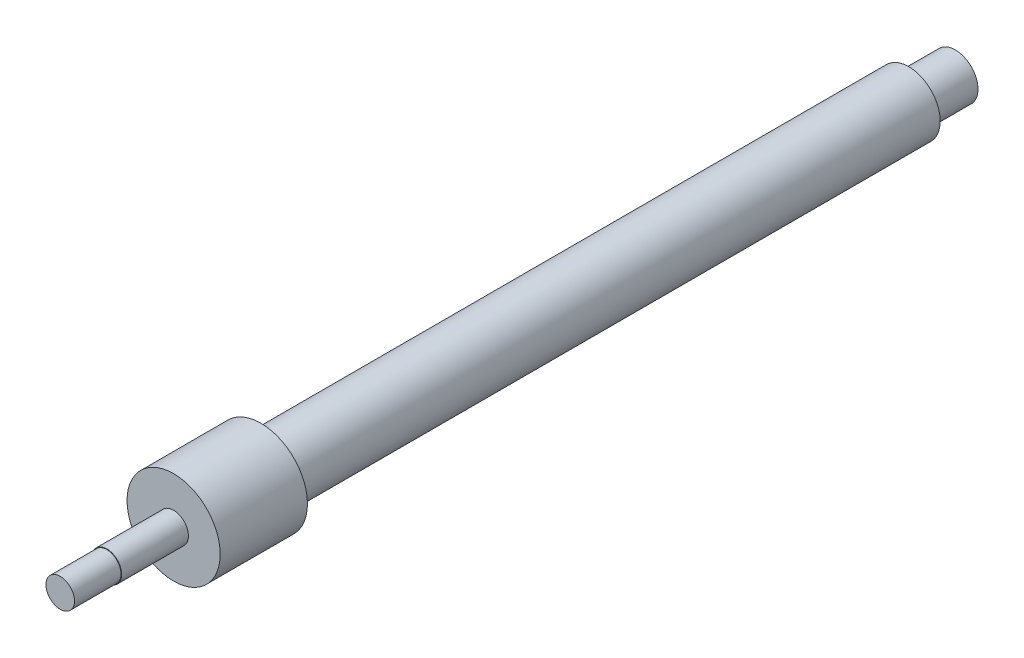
ISO-10303-21;
HEADER;
FILE_DESCRIPTION(('STEP AP214'),'2;1');
FILE_NAME('part.step','',(''),(''),'','','');
FILE_SCHEMA(('AUTOMOTIVE_DESIGN { 1 0 10303 214 1 1 1 1 }'));
ENDSEC;
DATA;
#1=APPLICATION_CONTEXT('core data for automotive mechanical design processes');
#2=APPLICATION_PROTOCOL_DEFINITION('international standard','automotive_design',2000,#1);
#3=PRODUCT_CONTEXT('',#1,'mechanical');
#4=PRODUCT('Part','Part','',(#3));
#5=PRODUCT_RELATED_PRODUCT_CATEGORY('part','',(#4));
#6=PRODUCT_DEFINITION_FORMATION('','',#4);
#7=PRODUCT_DEFINITION_CONTEXT('part definition',#1,'design');
#8=PRODUCT_DEFINITION('design','',#6,#7);
#9=PRODUCT_DEFINITION_SHAPE('','',#8);
#10=(LENGTH_UNIT() NAMED_UNIT(*) SI_UNIT(.MILLI.,.METRE.));
#11=(NAMED_UNIT(*) PLANE_ANGLE_UNIT() SI_UNIT($,.RADIAN.));
#12=(NAMED_UNIT(*) SI_UNIT($,.STERADIAN.) SOLID_ANGLE_UNIT());
#13=UNCERTAINTY_MEASURE_WITH_UNIT(LENGTH_MEASURE(1.E-05),#10,'distance_accuracy_value','');
#14=(GEOMETRIC_REPRESENTATION_CONTEXT(3) GLOBAL_UNCERTAINTY_ASSIGNED_CONTEXT((#13)) GLOBAL_UNIT_ASSIGNED_CONTEXT((#10,
#11,#12)) REPRESENTATION_CONTEXT('',''));
#15=CARTESIAN_POINT('',(0.,0.,0.));
#16=DIRECTION('',(0.,0.,1.));
#17=DIRECTION('',(1.,0.,0.));
#18=AXIS2_PLACEMENT_3D('',#15,#16,#17);
#19=CARTESIAN_POINT('',(0.,0.,0.));
#20=DIRECTION('',(0.,0.,1.));
#21=DIRECTION('',(1.,0.,0.));
#22=AXIS2_PLACEMENT_3D('',#19,#20,#21);
#23=PLANE('',#22);
#24=CARTESIAN_POINT('',(0.,0.,0.));
#25=DIRECTION('',(0.,0.,1.));
#26=DIRECTION('',(1.,0.,0.));
#27=AXIS2_PLACEMENT_3D('',#24,#25,#26);
#28=CIRCLE('',#27,2.7);
#29=CARTESIAN_POINT('',(2.7,0.,0.));
#30=VERTEX_POINT('',#29);
#31=EDGE_CURVE('E47',#30,#30,#28,.T.);
#32=ORIENTED_EDGE('',*,*,#31,.F.);
#33=EDGE_LOOP('',(#32));
#34=FACE_BOUND('',#33,.T.);
#35=CARTESIAN_POINT('',(0.,0.,0.));
#36=DIRECTION('',(0.,0.,1.));
#37=DIRECTION('',(1.,0.,0.));
#38=AXIS2_PLACEMENT_3D('',#35,#36,#37);
#39=CIRCLE('',#38,1.95);
#40=CARTESIAN_POINT('',(1.95,0.,0.));
#41=VERTEX_POINT('',#40);
#42=EDGE_CURVE('E10',#41,#41,#39,.F.);
#43=ORIENTED_EDGE('',*,*,#42,.F.);
#44=EDGE_LOOP('',(#43));
#45=FACE_BOUND('',#44,.T.);
#46=ADVANCED_FACE('F34',(#34,#45),#23,.F.);
#47=CARTESIAN_POINT('',(0.,0.,55.66));
#48=DIRECTION('',(0.,0.,-1.));
#49=DIRECTION('',(-1.,0.,0.));
#50=AXIS2_PLACEMENT_3D('',#47,#48,#49);
#51=CYLINDRICAL_SURFACE('',#50,2.7);
#52=CARTESIAN_POINT('',(0.,0.,55.66));
#53=DIRECTION('',(0.,0.,1.));
#54=DIRECTION('',(1.,0.,0.));
#55=AXIS2_PLACEMENT_3D('',#52,#53,#54);
#56=CIRCLE('',#55,2.7);
#57=CARTESIAN_POINT('',(2.7,0.,55.66));
#58=VERTEX_POINT('',#57);
#59=EDGE_CURVE('E42',#58,#58,#56,.T.);
#60=ORIENTED_EDGE('',*,*,#59,.F.);
#61=EDGE_LOOP('',(#60));
#62=FACE_BOUND('',#61,.T.);
#63=ORIENTED_EDGE('',*,*,#31,.T.);
#64=EDGE_LOOP('',(#63));
#65=FACE_BOUND('',#64,.T.);
#66=ADVANCED_FACE('F36',(#62,#65),#51,.T.);
#67=CARTESIAN_POINT('',(0.,0.,-4.));
#68=DIRECTION('',(0.,0.,1.));
#69=DIRECTION('',(1.,0.,0.));
#70=AXIS2_PLACEMENT_3D('',#67,#68,#69);
#71=CYLINDRICAL_SURFACE('',#70,1.95);
#72=CARTESIAN_POINT('',(0.,0.,-4.));
#73=DIRECTION('',(0.,0.,-1.));
#74=DIRECTION('',(-1.,0.,0.));
#75=AXIS2_PLACEMENT_3D('',#72,#73,#74);
#76=CIRCLE('',#75,1.95);
#77=CARTESIAN_POINT('',(-1.95,0.,-4.));
#78=VERTEX_POINT('',#77);
#79=EDGE_CURVE('E52',#78,#78,#76,.T.);
#80=ORIENTED_EDGE('',*,*,#79,.F.);
#81=EDGE_LOOP('',(#80));
#82=FACE_BOUND('',#81,.T.);
#83=ORIENTED_EDGE('',*,*,#42,.T.);
#84=EDGE_LOOP('',(#83));
#85=FACE_BOUND('',#84,.T.);
#86=ADVANCED_FACE('F80',(#82,#85),#71,.T.);
#87=CARTESIAN_POINT('',(0.,0.,-4.));
#88=DIRECTION('',(0.,0.,-1.));
#89=DIRECTION('',(-1.,0.,0.));
#90=AXIS2_PLACEMENT_3D('',#87,#88,#89);
#91=PLANE('',#90);
#92=ORIENTED_EDGE('',*,*,#79,.T.);
#93=EDGE_LOOP('',(#92));
#94=FACE_BOUND('',#93,.T.);
#95=ADVANCED_FACE('F93',(#94),#91,.T.);
#96=CARTESIAN_POINT('',(0.,0.,44.3462915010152));
#97=DIRECTION('',(0.,0.,1.));
#98=DIRECTION('',(1.,0.,0.));
#99=AXIS2_PLACEMENT_3D('',#96,#97,#98);
#100=CYLINDRICAL_SURFACE('',#99,4.);
#101=CARTESIAN_POINT('',(0.,0.,55.66));
#102=DIRECTION('',(0.,0.,1.));
#103=DIRECTION('',(1.,0.,0.));
#104=AXIS2_PLACEMENT_3D('',#101,#102,#103);
#105=CIRCLE('',#104,4.);
#106=CARTESIAN_POINT('',(4.,0.,55.66));
#107=VERTEX_POINT('',#106);
#108=EDGE_CURVE('E64',#107,#107,#105,.T.);
#109=ORIENTED_EDGE('',*,*,#108,.T.);
#110=EDGE_LOOP('',(#109));
#111=FACE_BOUND('',#110,.T.);
#112=CARTESIAN_POINT('',(0.,0.,63.16));
#113=DIRECTION('',(0.,0.,-1.));
#114=DIRECTION('',(-1.,0.,0.));
#115=AXIS2_PLACEMENT_3D('',#112,#113,#114);
#116=CIRCLE('',#115,4.);
#117=CARTESIAN_POINT('',(-4.,0.,63.16));
#118=VERTEX_POINT('',#117);
#119=EDGE_CURVE('E121',#118,#118,#116,.T.);
#120=ORIENTED_EDGE('',*,*,#119,.T.);
#121=EDGE_LOOP('',(#120));
#122=FACE_BOUND('',#121,.T.);
#123=ADVANCED_FACE('F97',(#111,#122),#100,.T.);
#124=CARTESIAN_POINT('',(0.,0.,55.66));
#125=DIRECTION('',(0.,0.,1.));
#126=DIRECTION('',(1.,0.,0.));
#127=AXIS2_PLACEMENT_3D('',#124,#125,#126);
#128=PLANE('',#127);
#129=ORIENTED_EDGE('',*,*,#59,.T.);
#130=EDGE_LOOP('',(#129));
#131=FACE_BOUND('',#130,.T.);
#132=ORIENTED_EDGE('',*,*,#108,.F.);
#133=EDGE_LOOP('',(#132));
#134=FACE_BOUND('',#133,.T.);
#135=ADVANCED_FACE('F108',(#131,#134),#128,.F.);
#136=CARTESIAN_POINT('',(0.,0.,63.16));
#137=DIRECTION('',(0.,0.,-1.));
#138=DIRECTION('',(-1.,0.,0.));
#139=AXIS2_PLACEMENT_3D('',#136,#137,#138);
#140=PLANE('',#139);
#141=CARTESIAN_POINT('',(0.,0.,63.16));
#142=DIRECTION('',(0.,0.,-1.));
#143=DIRECTION('',(-1.,0.,0.));
#144=AXIS2_PLACEMENT_3D('',#141,#142,#143);
#145=CIRCLE('',#144,1.275);
#146=CARTESIAN_POINT('',(-1.275,0.,63.16));
#147=VERTEX_POINT('',#146);
#148=EDGE_CURVE('E38',#147,#147,#145,.F.);
#149=ORIENTED_EDGE('',*,*,#148,.F.);
#150=EDGE_LOOP('',(#149));
#151=FACE_BOUND('',#150,.T.);
#152=ORIENTED_EDGE('',*,*,#119,.F.);
#153=EDGE_LOOP('',(#152));
#154=FACE_BOUND('',#153,.T.);
#155=ADVANCED_FACE('F90',(#151,#154),#140,.F.);
#156=CARTESIAN_POINT('',(0.,0.,72.9));
#157=DIRECTION('',(0.,0.,1.));
#158=DIRECTION('',(1.,0.,0.));
#159=AXIS2_PLACEMENT_3D('',#156,#157,#158);
#160=PLANE('',#159);
#161=CARTESIAN_POINT('',(0.,0.,72.9));
#162=DIRECTION('',(0.,0.,1.));
#163=DIRECTION('',(1.,0.,0.));
#164=AXIS2_PLACEMENT_3D('',#161,#162,#163);
#165=CIRCLE('',#164,1.225);
#166=CARTESIAN_POINT('',(1.225,0.,72.9));
#167=VERTEX_POINT('',#166);
#168=EDGE_CURVE('E57',#167,#167,#165,.T.);
#169=ORIENTED_EDGE('',*,*,#168,.T.);
#170=EDGE_LOOP('',(#169));
#171=FACE_BOUND('',#170,.T.);
#172=ADVANCED_FACE('F87',(#171),#160,.T.);
#173=CARTESIAN_POINT('',(0.,0.,72.9));
#174=DIRECTION('',(0.,0.,-1.));
#175=DIRECTION('',(-1.,0.,0.));
#176=AXIS2_PLACEMENT_3D('',#173,#174,#175);
#177=CYLINDRICAL_SURFACE('',#176,1.225);
#178=CARTESIAN_POINT('',(0.,0.,68.9));
#179=DIRECTION('',(0.,0.,1.));
#180=DIRECTION('',(1.,0.,0.));
#181=AXIS2_PLACEMENT_3D('',#178,#179,#180);
#182=CIRCLE('',#181,1.225);
#183=CARTESIAN_POINT('',(1.225,0.,68.9));
#184=VERTEX_POINT('',#183);
#185=EDGE_CURVE('E50',#184,#184,#182,.T.);
#186=ORIENTED_EDGE('',*,*,#185,.T.);
#187=EDGE_LOOP('',(#186));
#188=FACE_BOUND('',#187,.T.);
#189=ORIENTED_EDGE('',*,*,#168,.F.);
#190=EDGE_LOOP('',(#189));
#191=FACE_BOUND('',#190,.T.);
#192=ADVANCED_FACE('F83',(#188,#191),#177,.T.);
#193=CARTESIAN_POINT('',(0.,0.,68.9));
#194=DIRECTION('',(0.,0.,1.));
#195=DIRECTION('',(1.,0.,0.));
#196=AXIS2_PLACEMENT_3D('',#193,#194,#195);
#197=PLANE('',#196);
#198=ORIENTED_EDGE('',*,*,#185,.F.);
#199=EDGE_LOOP('',(#198));
#200=FACE_BOUND('',#199,.T.);
#201=CARTESIAN_POINT('',(0.,0.,68.9));
#202=DIRECTION('',(0.,0.,1.));
#203=DIRECTION('',(1.,0.,0.));
#204=AXIS2_PLACEMENT_3D('',#201,#202,#203);
#205=CIRCLE('',#204,1.275);
#206=CARTESIAN_POINT('',(1.275,0.,68.9));
#207=VERTEX_POINT('',#206);
#208=EDGE_CURVE('E53',#207,#207,#205,.T.);
#209=ORIENTED_EDGE('',*,*,#208,.T.);
#210=EDGE_LOOP('',(#209));
#211=FACE_BOUND('',#210,.T.);
#212=ADVANCED_FACE('F86',(#200,#211),#197,.T.);
#213=CARTESIAN_POINT('',(0.,0.,61.9));
#214=DIRECTION('',(0.,0.,1.));
#215=DIRECTION('',(1.,0.,0.));
#216=AXIS2_PLACEMENT_3D('',#213,#214,#215);
#217=CYLINDRICAL_SURFACE('',#216,1.275);
#218=ORIENTED_EDGE('',*,*,#208,.F.);
#219=EDGE_LOOP('',(#218));
#220=FACE_BOUND('',#219,.T.);
#221=ORIENTED_EDGE('',*,*,#148,.T.);
#222=EDGE_LOOP('',(#221));
#223=FACE_BOUND('',#222,.T.);
#224=ADVANCED_FACE('F99',(#220,#223),#217,.T.);
#225=CLOSED_SHELL('',(#46,#66,#86,#95,#123,#135,#155,#172,#192,#212,#224));
#226=MANIFOLD_SOLID_BREP('B2',#225);
#227=ADVANCED_BREP_SHAPE_REPRESENTATION('',(#18,#226),#14);
#228=SHAPE_DEFINITION_REPRESENTATION(#9,#227);
ENDSEC;
END-ISO-10303-21;
